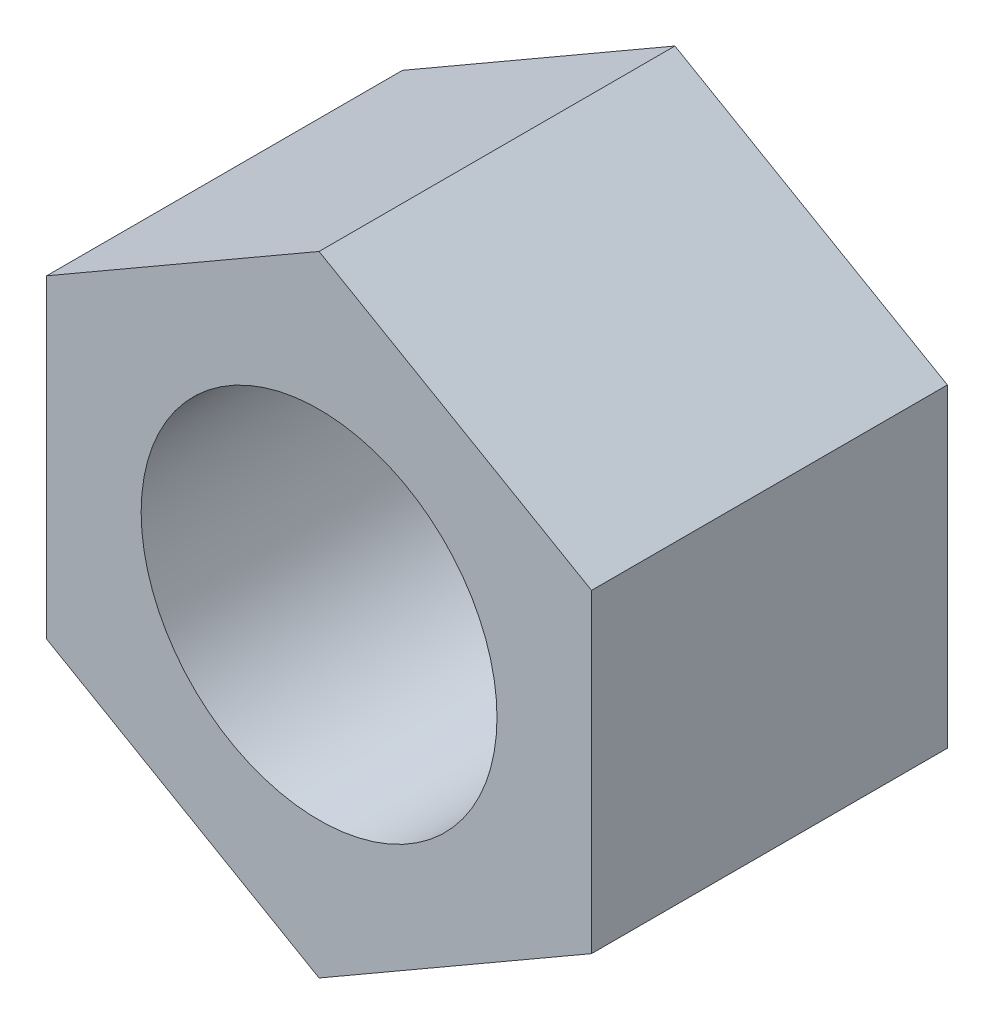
ISO-10303-21;
HEADER;
FILE_DESCRIPTION(('STEP AP214'),'2;1');
FILE_NAME('part.step','',(''),(''),'','','');
FILE_SCHEMA(('AUTOMOTIVE_DESIGN { 1 0 10303 214 1 1 1 1 }'));
ENDSEC;
DATA;
#1=APPLICATION_CONTEXT('core data for automotive mechanical design processes');
#2=APPLICATION_PROTOCOL_DEFINITION('international standard','automotive_design',2000,#1);
#3=PRODUCT_CONTEXT('',#1,'mechanical');
#4=PRODUCT('Part','Part','',(#3));
#5=PRODUCT_RELATED_PRODUCT_CATEGORY('part','',(#4));
#6=PRODUCT_DEFINITION_FORMATION('','',#4);
#7=PRODUCT_DEFINITION_CONTEXT('part definition',#1,'design');
#8=PRODUCT_DEFINITION('design','',#6,#7);
#9=PRODUCT_DEFINITION_SHAPE('','',#8);
#10=(LENGTH_UNIT() NAMED_UNIT(*) SI_UNIT(.MILLI.,.METRE.));
#11=(NAMED_UNIT(*) PLANE_ANGLE_UNIT() SI_UNIT($,.RADIAN.));
#12=(NAMED_UNIT(*) SI_UNIT($,.STERADIAN.) SOLID_ANGLE_UNIT());
#13=UNCERTAINTY_MEASURE_WITH_UNIT(LENGTH_MEASURE(1.E-05),#10,'distance_accuracy_value','');
#14=(GEOMETRIC_REPRESENTATION_CONTEXT(3) GLOBAL_UNCERTAINTY_ASSIGNED_CONTEXT((#13)) GLOBAL_UNIT_ASSIGNED_CONTEXT((#10,
#11,#12)) REPRESENTATION_CONTEXT('',''));
#15=CARTESIAN_POINT('',(0.,0.,0.));
#16=DIRECTION('',(0.,0.,1.));
#17=DIRECTION('',(1.,0.,0.));
#18=AXIS2_PLACEMENT_3D('',#15,#16,#17);
#19=CARTESIAN_POINT('',(0.,0.,25.4));
#20=DIRECTION('',(0.,0.,1.));
#21=DIRECTION('',(1.,0.,0.));
#22=AXIS2_PLACEMENT_3D('',#19,#20,#21);
#23=PLANE('',#22);
#24=DIRECTION('',(0.,1.,0.));
#25=VECTOR('',#24,1.);
#26=CARTESIAN_POINT('',(38.89375,-22.455317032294,25.4));
#27=LINE('',#26,#25);
#28=CARTESIAN_POINT('',(38.89375,-22.455317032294,25.4));
#29=VERTEX_POINT('',#28);
#30=CARTESIAN_POINT('',(38.89375,22.455317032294,25.4));
#31=VERTEX_POINT('',#30);
#32=EDGE_CURVE('E137',#29,#31,#27,.T.);
#33=ORIENTED_EDGE('',*,*,#32,.T.);
#34=DIRECTION('',(-0.866025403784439,0.5,0.));
#35=VECTOR('',#34,1.);
#36=CARTESIAN_POINT('',(38.89375,22.455317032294,25.4));
#37=LINE('',#36,#35);
#38=CARTESIAN_POINT('',(0.,44.910634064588,25.4));
#39=VERTEX_POINT('',#38);
#40=EDGE_CURVE('E100',#31,#39,#37,.T.);
#41=ORIENTED_EDGE('',*,*,#40,.T.);
#42=DIRECTION('',(-0.866025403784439,-0.5,0.));
#43=VECTOR('',#42,1.);
#44=CARTESIAN_POINT('',(0.,44.910634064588,25.4));
#45=LINE('',#44,#43);
#46=CARTESIAN_POINT('',(-38.89375,22.455317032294,25.4));
#47=VERTEX_POINT('',#46);
#48=EDGE_CURVE('E110',#39,#47,#45,.T.);
#49=ORIENTED_EDGE('',*,*,#48,.T.);
#50=DIRECTION('',(0.,-1.,0.));
#51=VECTOR('',#50,1.);
#52=CARTESIAN_POINT('',(-38.89375,22.455317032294,25.4));
#53=LINE('',#52,#51);
#54=CARTESIAN_POINT('',(-38.89375,-22.455317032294,25.4));
#55=VERTEX_POINT('',#54);
#56=EDGE_CURVE('E101',#47,#55,#53,.T.);
#57=ORIENTED_EDGE('',*,*,#56,.T.);
#58=DIRECTION('',(0.866025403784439,-0.5,0.));
#59=VECTOR('',#58,1.);
#60=CARTESIAN_POINT('',(-38.89375,-22.455317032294,25.4));
#61=LINE('',#60,#59);
#62=CARTESIAN_POINT('',(0.,-44.910634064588,25.4));
#63=VERTEX_POINT('',#62);
#64=EDGE_CURVE('E109',#55,#63,#61,.T.);
#65=ORIENTED_EDGE('',*,*,#64,.T.);
#66=DIRECTION('',(0.866025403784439,0.5,0.));
#67=VECTOR('',#66,1.);
#68=CARTESIAN_POINT('',(0.,-44.910634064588,25.4));
#69=LINE('',#68,#67);
#70=EDGE_CURVE('E58',#63,#29,#69,.T.);
#71=ORIENTED_EDGE('',*,*,#70,.T.);
#72=EDGE_LOOP('',(#33,#41,#49,#57,#65,#71));
#73=FACE_BOUND('',#72,.T.);
#74=CARTESIAN_POINT('',(0.,0.,25.4));
#75=DIRECTION('',(0.,0.,1.));
#76=DIRECTION('',(1.,0.,0.));
#77=AXIS2_PLACEMENT_3D('',#74,#75,#76);
#78=CIRCLE('',#77,25.4);
#79=CARTESIAN_POINT('',(25.4,0.,25.4));
#80=VERTEX_POINT('',#79);
#81=EDGE_CURVE('E135',#80,#80,#78,.T.);
#82=ORIENTED_EDGE('',*,*,#81,.F.);
#83=EDGE_LOOP('',(#82));
#84=FACE_BOUND('',#83,.T.);
#85=ADVANCED_FACE('F43',(#73,#84),#23,.T.);
#86=CARTESIAN_POINT('',(0.,0.,-25.4));
#87=DIRECTION('',(0.,0.,1.));
#88=DIRECTION('',(1.,0.,0.));
#89=AXIS2_PLACEMENT_3D('',#86,#87,#88);
#90=PLANE('',#89);
#91=DIRECTION('',(0.,1.,0.));
#92=VECTOR('',#91,1.);
#93=CARTESIAN_POINT('',(38.89375,-22.455317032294,-25.4));
#94=LINE('',#93,#92);
#95=CARTESIAN_POINT('',(38.89375,-22.455317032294,-25.4));
#96=VERTEX_POINT('',#95);
#97=CARTESIAN_POINT('',(38.89375,22.455317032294,-25.4));
#98=VERTEX_POINT('',#97);
#99=EDGE_CURVE('E126',#96,#98,#94,.T.);
#100=ORIENTED_EDGE('',*,*,#99,.F.);
#101=DIRECTION('',(0.866025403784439,0.5,0.));
#102=VECTOR('',#101,1.);
#103=CARTESIAN_POINT('',(0.,-44.910634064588,-25.4));
#104=LINE('',#103,#102);
#105=CARTESIAN_POINT('',(0.,-44.910634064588,-25.4));
#106=VERTEX_POINT('',#105);
#107=EDGE_CURVE('E87',#106,#96,#104,.T.);
#108=ORIENTED_EDGE('',*,*,#107,.F.);
#109=DIRECTION('',(0.866025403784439,-0.5,0.));
#110=VECTOR('',#109,1.);
#111=CARTESIAN_POINT('',(-38.89375,-22.455317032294,-25.4));
#112=LINE('',#111,#110);
#113=CARTESIAN_POINT('',(-38.89375,-22.455317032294,-25.4));
#114=VERTEX_POINT('',#113);
#115=EDGE_CURVE('E81',#114,#106,#112,.T.);
#116=ORIENTED_EDGE('',*,*,#115,.F.);
#117=DIRECTION('',(0.,-1.,0.));
#118=VECTOR('',#117,1.);
#119=CARTESIAN_POINT('',(-38.89375,22.455317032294,-25.4));
#120=LINE('',#119,#118);
#121=CARTESIAN_POINT('',(-38.89375,22.455317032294,-25.4));
#122=VERTEX_POINT('',#121);
#123=EDGE_CURVE('E119',#122,#114,#120,.T.);
#124=ORIENTED_EDGE('',*,*,#123,.F.);
#125=DIRECTION('',(-0.866025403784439,-0.5,0.));
#126=VECTOR('',#125,1.);
#127=CARTESIAN_POINT('',(0.,44.910634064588,-25.4));
#128=LINE('',#127,#126);
#129=CARTESIAN_POINT('',(0.,44.910634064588,-25.4));
#130=VERTEX_POINT('',#129);
#131=EDGE_CURVE('E132',#130,#122,#128,.T.);
#132=ORIENTED_EDGE('',*,*,#131,.F.);
#133=DIRECTION('',(-0.866025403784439,0.5,0.));
#134=VECTOR('',#133,1.);
#135=CARTESIAN_POINT('',(38.89375,22.455317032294,-25.4));
#136=LINE('',#135,#134);
#137=EDGE_CURVE('E131',#98,#130,#136,.T.);
#138=ORIENTED_EDGE('',*,*,#137,.F.);
#139=EDGE_LOOP('',(#100,#108,#116,#124,#132,#138));
#140=FACE_BOUND('',#139,.T.);
#141=CARTESIAN_POINT('',(0.,0.,-25.4));
#142=DIRECTION('',(0.,0.,1.));
#143=DIRECTION('',(1.,0.,0.));
#144=AXIS2_PLACEMENT_3D('',#141,#142,#143);
#145=CIRCLE('',#144,25.4);
#146=CARTESIAN_POINT('',(25.4,0.,-25.4));
#147=VERTEX_POINT('',#146);
#148=EDGE_CURVE('E235',#147,#147,#145,.T.);
#149=ORIENTED_EDGE('',*,*,#148,.T.);
#150=EDGE_LOOP('',(#149));
#151=FACE_BOUND('',#150,.T.);
#152=ADVANCED_FACE('F149',(#140,#151),#90,.F.);
#153=CARTESIAN_POINT('',(38.89375,-22.455317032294,25.4));
#154=DIRECTION('',(-1.,0.,0.));
#155=DIRECTION('',(0.,-1.,0.));
#156=AXIS2_PLACEMENT_3D('',#153,#154,#155);
#157=PLANE('',#156);
#158=ORIENTED_EDGE('',*,*,#99,.T.);
#159=DIRECTION('',(0.,0.,-1.));
#160=VECTOR('',#159,1.);
#161=CARTESIAN_POINT('',(38.89375,22.455317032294,25.4));
#162=LINE('',#161,#160);
#163=EDGE_CURVE('E11',#31,#98,#162,.T.);
#164=ORIENTED_EDGE('',*,*,#163,.F.);
#165=ORIENTED_EDGE('',*,*,#32,.F.);
#166=DIRECTION('',(0.,0.,-1.));
#167=VECTOR('',#166,1.);
#168=CARTESIAN_POINT('',(38.89375,-22.455317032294,25.4));
#169=LINE('',#168,#167);
#170=EDGE_CURVE('E125',#29,#96,#169,.T.);
#171=ORIENTED_EDGE('',*,*,#170,.T.);
#172=EDGE_LOOP('',(#158,#164,#165,#171));
#173=FACE_BOUND('',#172,.T.);
#174=ADVANCED_FACE('F44',(#173),#157,.F.);
#175=CARTESIAN_POINT('',(38.89375,22.455317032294,25.4));
#176=DIRECTION('',(-0.5,-0.866025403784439,0.));
#177=DIRECTION('',(0.866025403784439,-0.5,0.));
#178=AXIS2_PLACEMENT_3D('',#175,#176,#177);
#179=PLANE('',#178);
#180=ORIENTED_EDGE('',*,*,#137,.T.);
#181=DIRECTION('',(0.,0.,-1.));
#182=VECTOR('',#181,1.);
#183=CARTESIAN_POINT('',(0.,44.910634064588,25.4));
#184=LINE('',#183,#182);
#185=EDGE_CURVE('E55',#39,#130,#184,.T.);
#186=ORIENTED_EDGE('',*,*,#185,.F.);
#187=ORIENTED_EDGE('',*,*,#40,.F.);
#188=ORIENTED_EDGE('',*,*,#163,.T.);
#189=EDGE_LOOP('',(#180,#186,#187,#188));
#190=FACE_BOUND('',#189,.T.);
#191=ADVANCED_FACE('F171',(#190),#179,.F.);
#192=CARTESIAN_POINT('',(0.,44.910634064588,25.4));
#193=DIRECTION('',(0.5,-0.866025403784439,0.));
#194=DIRECTION('',(0.866025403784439,0.5,0.));
#195=AXIS2_PLACEMENT_3D('',#192,#193,#194);
#196=PLANE('',#195);
#197=ORIENTED_EDGE('',*,*,#131,.T.);
#198=DIRECTION('',(0.,0.,-1.));
#199=VECTOR('',#198,1.);
#200=CARTESIAN_POINT('',(-38.89375,22.455317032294,25.4));
#201=LINE('',#200,#199);
#202=EDGE_CURVE('E118',#47,#122,#201,.T.);
#203=ORIENTED_EDGE('',*,*,#202,.F.);
#204=ORIENTED_EDGE('',*,*,#48,.F.);
#205=ORIENTED_EDGE('',*,*,#185,.T.);
#206=EDGE_LOOP('',(#197,#203,#204,#205));
#207=FACE_BOUND('',#206,.T.);
#208=ADVANCED_FACE('F144',(#207),#196,.F.);
#209=CARTESIAN_POINT('',(-38.89375,22.455317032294,25.4));
#210=DIRECTION('',(1.,0.,0.));
#211=DIRECTION('',(0.,0.,-1.));
#212=AXIS2_PLACEMENT_3D('',#209,#210,#211);
#213=PLANE('',#212);
#214=ORIENTED_EDGE('',*,*,#123,.T.);
#215=DIRECTION('',(0.,0.,-1.));
#216=VECTOR('',#215,1.);
#217=CARTESIAN_POINT('',(-38.89375,-22.455317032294,25.4));
#218=LINE('',#217,#216);
#219=EDGE_CURVE('E113',#55,#114,#218,.T.);
#220=ORIENTED_EDGE('',*,*,#219,.F.);
#221=ORIENTED_EDGE('',*,*,#56,.F.);
#222=ORIENTED_EDGE('',*,*,#202,.T.);
#223=EDGE_LOOP('',(#214,#220,#221,#222));
#224=FACE_BOUND('',#223,.T.);
#225=ADVANCED_FACE('F116',(#224),#213,.F.);
#226=CARTESIAN_POINT('',(-38.89375,-22.455317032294,25.4));
#227=DIRECTION('',(0.5,0.866025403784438,0.));
#228=DIRECTION('',(-0.866025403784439,0.5,0.));
#229=AXIS2_PLACEMENT_3D('',#226,#227,#228);
#230=PLANE('',#229);
#231=ORIENTED_EDGE('',*,*,#115,.T.);
#232=DIRECTION('',(0.,0.,-1.));
#233=VECTOR('',#232,1.);
#234=CARTESIAN_POINT('',(0.,-44.910634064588,25.4));
#235=LINE('',#234,#233);
#236=EDGE_CURVE('E120',#63,#106,#235,.T.);
#237=ORIENTED_EDGE('',*,*,#236,.F.);
#238=ORIENTED_EDGE('',*,*,#64,.F.);
#239=ORIENTED_EDGE('',*,*,#219,.T.);
#240=EDGE_LOOP('',(#231,#237,#238,#239));
#241=FACE_BOUND('',#240,.T.);
#242=ADVANCED_FACE('F122',(#241),#230,.F.);
#243=CARTESIAN_POINT('',(0.,-44.910634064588,25.4));
#244=DIRECTION('',(-0.5,0.866025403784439,0.));
#245=DIRECTION('',(-0.866025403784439,-0.5,0.));
#246=AXIS2_PLACEMENT_3D('',#243,#244,#245);
#247=PLANE('',#246);
#248=ORIENTED_EDGE('',*,*,#107,.T.);
#249=ORIENTED_EDGE('',*,*,#170,.F.);
#250=ORIENTED_EDGE('',*,*,#70,.F.);
#251=ORIENTED_EDGE('',*,*,#236,.T.);
#252=EDGE_LOOP('',(#248,#249,#250,#251));
#253=FACE_BOUND('',#252,.T.);
#254=ADVANCED_FACE('F154',(#253),#247,.F.);
#255=CARTESIAN_POINT('',(0.,0.,25.4));
#256=DIRECTION('',(0.,0.,-1.));
#257=DIRECTION('',(-1.,0.,0.));
#258=AXIS2_PLACEMENT_3D('',#255,#256,#257);
#259=CYLINDRICAL_SURFACE('',#258,25.4);
#260=ORIENTED_EDGE('',*,*,#81,.T.);
#261=EDGE_LOOP('',(#260));
#262=FACE_BOUND('',#261,.T.);
#263=ORIENTED_EDGE('',*,*,#148,.F.);
#264=EDGE_LOOP('',(#263));
#265=FACE_BOUND('',#264,.T.);
#266=ADVANCED_FACE('F155',(#262,#265),#259,.F.);
#267=CLOSED_SHELL('',(#85,#152,#174,#191,#208,#225,#242,#254,#266));
#268=MANIFOLD_SOLID_BREP('B2',#267);
#269=ADVANCED_BREP_SHAPE_REPRESENTATION('',(#18,#268),#14);
#270=SHAPE_DEFINITION_REPRESENTATION(#9,#269);
ENDSEC;
END-ISO-10303-21;
